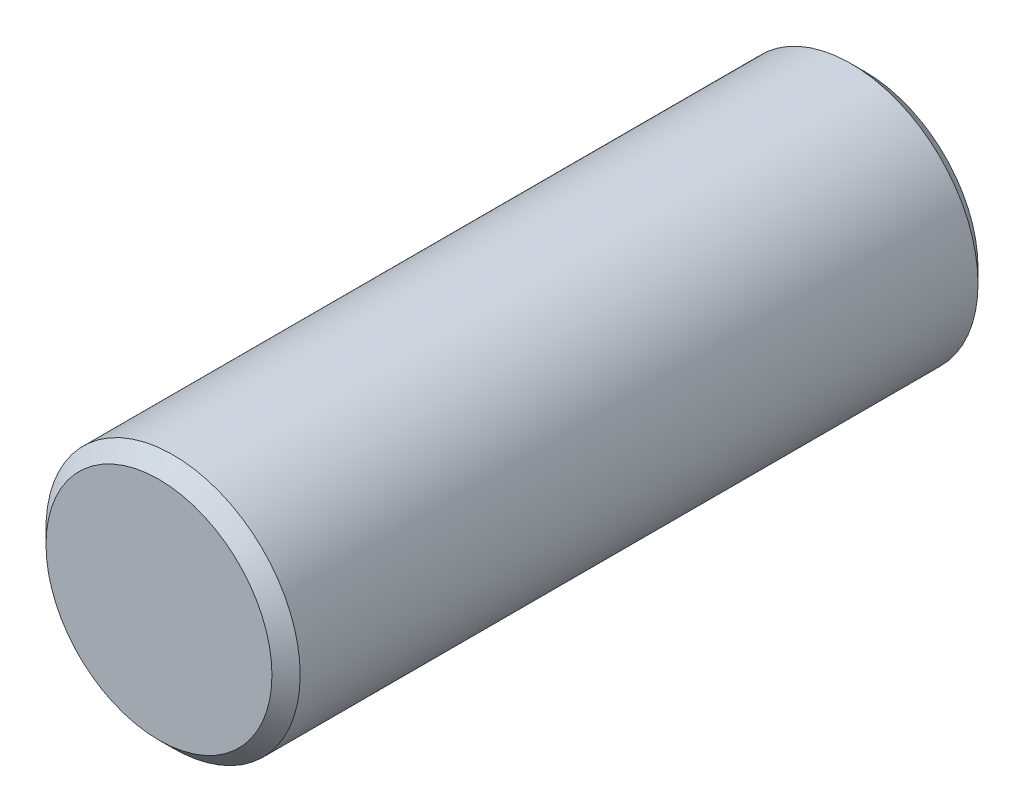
from build123d import *

# Parameters (mm, degrees)
ESQUISSE1_R        = 9
BOSS_EXTRU_1_DEPTH = 50
CHANFREIN1_SIZE    = 1


with BuildPart() as part:
    # Esquisse1 → Boss.-Extru.1 (new body)
    with BuildSketch(Plane.XY):
        Circle(ESQUISSE1_R)
    extrude(amount=BOSS_EXTRU_1_DEPTH)

    # Chanfrein1
    chanfrein1_edges = [part.edges().sort_by_distance(p)[0] for p in [
        (-9, 0, 0),
        (-9, 0, 50),
    ]]
    chamfer(chanfrein1_edges, length=CHANFREIN1_SIZE)


solid = part.part
